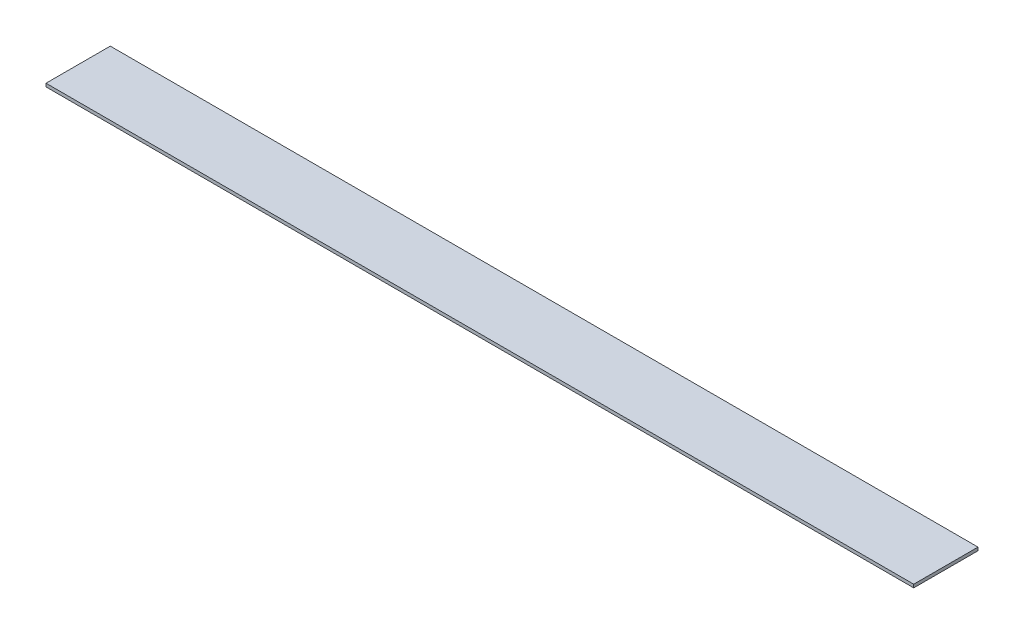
from build123d import *

# Parameters (mm, degrees)
ESQUISSE1_W      = 270
ESQUISSE1_H      = 1
EXTRUSION1_DEPTH = 20


with BuildPart() as part:
    # Esquisse1 → Extrusion1 (new body)
    with BuildSketch(Plane.XY):
        with Locations((135, 0.5)):
            Rectangle(ESQUISSE1_W, ESQUISSE1_H)
    extrude(amount=-EXTRUSION1_DEPTH)


solid = part.part
